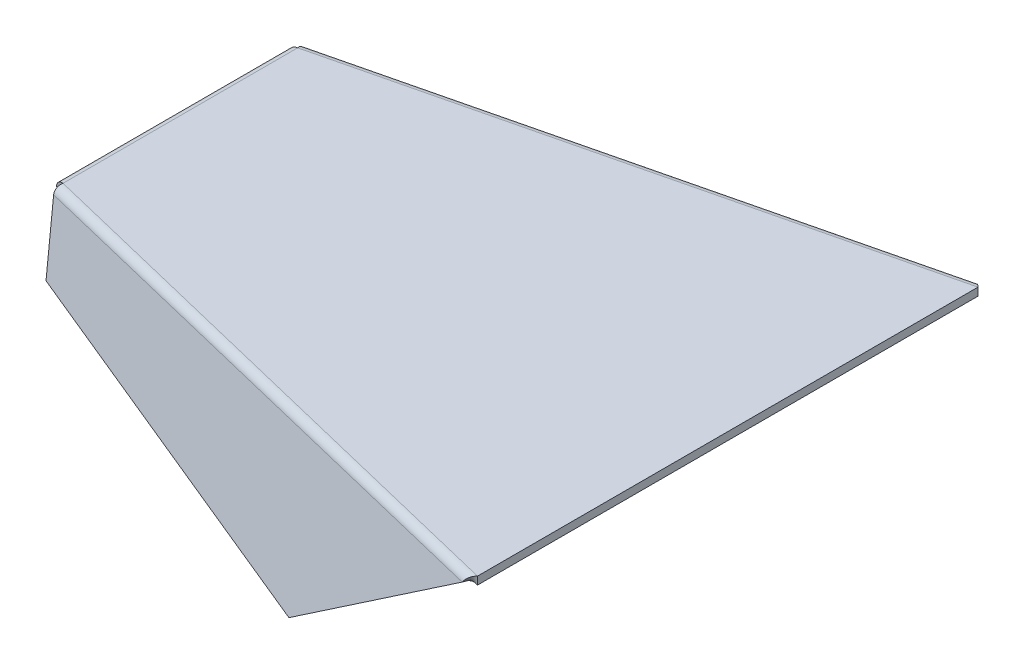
ISO-10303-21;
HEADER;
FILE_DESCRIPTION(('STEP AP214'),'2;1');
FILE_NAME('part.step','',(''),(''),'','','');
FILE_SCHEMA(('AUTOMOTIVE_DESIGN { 1 0 10303 214 1 1 1 1 }'));
ENDSEC;
DATA;
#1=APPLICATION_CONTEXT('core data for automotive mechanical design processes');
#2=APPLICATION_PROTOCOL_DEFINITION('international standard','automotive_design',2000,#1);
#3=PRODUCT_CONTEXT('',#1,'mechanical');
#4=PRODUCT('Part','Part','',(#3));
#5=PRODUCT_RELATED_PRODUCT_CATEGORY('part','',(#4));
#6=PRODUCT_DEFINITION_FORMATION('','',#4);
#7=PRODUCT_DEFINITION_CONTEXT('part definition',#1,'design');
#8=PRODUCT_DEFINITION('design','',#6,#7);
#9=PRODUCT_DEFINITION_SHAPE('','',#8);
#10=(LENGTH_UNIT() NAMED_UNIT(*) SI_UNIT(.MILLI.,.METRE.));
#11=(NAMED_UNIT(*) PLANE_ANGLE_UNIT() SI_UNIT($,.RADIAN.));
#12=(NAMED_UNIT(*) SI_UNIT($,.STERADIAN.) SOLID_ANGLE_UNIT());
#13=UNCERTAINTY_MEASURE_WITH_UNIT(LENGTH_MEASURE(1.E-05),#10,'distance_accuracy_value','');
#14=(GEOMETRIC_REPRESENTATION_CONTEXT(3) GLOBAL_UNCERTAINTY_ASSIGNED_CONTEXT((#13)) GLOBAL_UNIT_ASSIGNED_CONTEXT((#10,
#11,#12)) REPRESENTATION_CONTEXT('',''));
#15=CARTESIAN_POINT('',(0.,0.,0.));
#16=DIRECTION('',(0.,0.,1.));
#17=DIRECTION('',(1.,0.,0.));
#18=AXIS2_PLACEMENT_3D('',#15,#16,#17);
#19=CARTESIAN_POINT('',(35.9989999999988,-0.214031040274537,-15.));
#20=DIRECTION('',(0.,-0.2359973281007,-0.97175370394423));
#21=DIRECTION('',(0.,-0.97175370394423,0.2359973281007));
#22=AXIS2_PLACEMENT_3D('',#19,#20,#21);
#23=PLANE('',#22);
#24=DIRECTION('',(0.,-0.97175370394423,0.2359973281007));
#25=VECTOR('',#24,1.);
#26=CARTESIAN_POINT('',(34.9989999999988,-0.214031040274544,-15.));
#27=LINE('',#26,#25);
#28=CARTESIAN_POINT('',(34.9989999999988,-1.00100000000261,-14.8088789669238));
#29=VERTEX_POINT('',#28);
#30=CARTESIAN_POINT('',(34.9989999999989,-6.21403104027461,-13.5428571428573));
#31=VERTEX_POINT('',#30);
#32=EDGE_CURVE('E127',#29,#31,#27,.T.);
#33=ORIENTED_EDGE('',*,*,#32,.F.);
#34=CARTESIAN_POINT('',(35.9989999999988,-1.001,-14.8088789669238));
#35=CARTESIAN_POINT('',(34.9989999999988,-1.001,-14.8088789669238));
#36=B_SPLINE_CURVE_WITH_KNOTS('',1,(#34,#35),.UNSPECIFIED.,.F.,.F.,(2,2),(0.,1.),.UNSPECIFIED.);
#37=CARTESIAN_POINT('',(35.9989999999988,-1.001,-14.8088789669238));
#38=VERTEX_POINT('',#37);
#39=EDGE_CURVE('E251',#29,#38,#36,.F.);
#40=ORIENTED_EDGE('',*,*,#39,.T.);
#41=DIRECTION('',(0.,-0.97175370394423,0.2359973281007));
#42=VECTOR('',#41,1.);
#43=CARTESIAN_POINT('',(35.9989999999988,-0.214031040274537,-15.));
#44=LINE('',#43,#42);
#45=CARTESIAN_POINT('',(35.9989999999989,-6.2140310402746,-13.5428571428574));
#46=VERTEX_POINT('',#45);
#47=EDGE_CURVE('E268',#38,#46,#44,.T.);
#48=ORIENTED_EDGE('',*,*,#47,.T.);
#49=CARTESIAN_POINT('',(34.9989999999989,-6.21403104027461,-13.5428571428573));
#50=CARTESIAN_POINT('',(35.9989999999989,-6.2140310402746,-13.5428571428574));
#51=B_SPLINE_CURVE_WITH_KNOTS('',1,(#49,#50),.UNSPECIFIED.,.F.,.F.,(2,2),(0.,1.),.UNSPECIFIED.);
#52=EDGE_CURVE('E252',#31,#46,#51,.T.);
#53=ORIENTED_EDGE('',*,*,#52,.F.);
#54=EDGE_LOOP('',(#33,#40,#48,#53));
#55=FACE_BOUND('',#54,.T.);
#56=ADVANCED_FACE('F100',(#55),#23,.T.);
#57=CARTESIAN_POINT('',(35.999,-0.214031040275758,15.));
#58=DIRECTION('',(0.,-0.235997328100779,0.971753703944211));
#59=DIRECTION('',(0.,0.971753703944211,0.235997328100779));
#60=AXIS2_PLACEMENT_3D('',#57,#58,#59);
#61=PLANE('',#60);
#62=DIRECTION('',(0.,0.971753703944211,0.235997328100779));
#63=VECTOR('',#62,1.);
#64=CARTESIAN_POINT('',(35.999,-0.214031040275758,15.));
#65=LINE('',#64,#63);
#66=CARTESIAN_POINT('',(35.999,-6.21403104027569,13.5428571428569));
#67=VERTEX_POINT('',#66);
#68=CARTESIAN_POINT('',(35.999,-1.001,14.8088789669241));
#69=VERTEX_POINT('',#68);
#70=EDGE_CURVE('E274',#67,#69,#65,.T.);
#71=ORIENTED_EDGE('',*,*,#70,.T.);
#72=CARTESIAN_POINT('',(34.999,-1.001,14.8088789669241));
#73=CARTESIAN_POINT('',(35.999,-1.001,14.8088789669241));
#74=B_SPLINE_CURVE_WITH_KNOTS('',1,(#72,#73),.UNSPECIFIED.,.F.,.F.,(2,2),(0.,1.),.UNSPECIFIED.);
#75=CARTESIAN_POINT('',(34.999,-1.00100000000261,14.8088789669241));
#76=VERTEX_POINT('',#75);
#77=EDGE_CURVE('E14',#69,#76,#74,.F.);
#78=ORIENTED_EDGE('',*,*,#77,.T.);
#79=DIRECTION('',(0.,0.971753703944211,0.235997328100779));
#80=VECTOR('',#79,1.);
#81=CARTESIAN_POINT('',(34.999,-0.214031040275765,15.));
#82=LINE('',#81,#80);
#83=CARTESIAN_POINT('',(34.999,-6.2140310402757,13.5428571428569));
#84=VERTEX_POINT('',#83);
#85=EDGE_CURVE('E275',#84,#76,#82,.T.);
#86=ORIENTED_EDGE('',*,*,#85,.F.);
#87=CARTESIAN_POINT('',(35.999,-6.21403104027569,13.5428571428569));
#88=CARTESIAN_POINT('',(34.999,-6.2140310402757,13.5428571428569));
#89=B_SPLINE_CURVE_WITH_KNOTS('',1,(#87,#88),.UNSPECIFIED.,.F.,.F.,(2,2),(0.,1.),.UNSPECIFIED.);
#90=EDGE_CURVE('E310',#67,#84,#89,.T.);
#91=ORIENTED_EDGE('',*,*,#90,.F.);
#92=EDGE_LOOP('',(#71,#78,#86,#91));
#93=FACE_BOUND('',#92,.T.);
#94=ADVANCED_FACE('F102',(#93),#61,.T.);
#95=CARTESIAN_POINT('',(35.9989999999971,16.5295632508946,-53.9442117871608));
#96=DIRECTION('',(1.,0.,0.));
#97=DIRECTION('',(0.,0.,-1.));
#98=AXIS2_PLACEMENT_3D('',#95,#96,#97);
#99=PLANE('',#98);
#100=ORIENTED_EDGE('',*,*,#47,.F.);
#101=DIRECTION('',(0.,0.,1.));
#102=VECTOR('',#101,1.);
#103=CARTESIAN_POINT('',(35.9989999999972,-1.001,-53.9442117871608));
#104=LINE('',#103,#102);
#105=EDGE_CURVE('E242',#38,#69,#104,.T.);
#106=ORIENTED_EDGE('',*,*,#105,.T.);
#107=ORIENTED_EDGE('',*,*,#70,.F.);
#108=DIRECTION('',(0.,0.,1.));
#109=VECTOR('',#108,1.);
#110=CARTESIAN_POINT('',(35.9989999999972,-6.21403104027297,-53.9442117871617));
#111=LINE('',#110,#109);
#112=EDGE_CURVE('E271',#46,#67,#111,.T.);
#113=ORIENTED_EDGE('',*,*,#112,.F.);
#114=EDGE_LOOP('',(#100,#106,#107,#113));
#115=FACE_BOUND('',#114,.T.);
#116=ADVANCED_FACE('F269',(#115),#99,.T.);
#117=CARTESIAN_POINT('',(34.9989999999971,16.5295632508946,-53.9442117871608));
#118=DIRECTION('',(1.,0.,0.));
#119=DIRECTION('',(0.,0.,-1.));
#120=AXIS2_PLACEMENT_3D('',#117,#118,#119);
#121=PLANE('',#120);
#122=DIRECTION('',(0.,0.,1.));
#123=VECTOR('',#122,1.);
#124=CARTESIAN_POINT('',(34.9989999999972,-1.00100000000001,-53.9442117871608));
#125=LINE('',#124,#123);
#126=EDGE_CURVE('E111',#29,#76,#125,.T.);
#127=ORIENTED_EDGE('',*,*,#126,.F.);
#128=ORIENTED_EDGE('',*,*,#32,.T.);
#129=DIRECTION('',(0.,0.,1.));
#130=VECTOR('',#129,1.);
#131=CARTESIAN_POINT('',(34.9989999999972,-6.21403104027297,-53.9442117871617));
#132=LINE('',#131,#130);
#133=EDGE_CURVE('E303',#31,#84,#132,.T.);
#134=ORIENTED_EDGE('',*,*,#133,.T.);
#135=ORIENTED_EDGE('',*,*,#85,.T.);
#136=EDGE_LOOP('',(#127,#128,#134,#135));
#137=FACE_BOUND('',#136,.T.);
#138=ADVANCED_FACE('F295',(#137),#121,.F.);
#139=CARTESIAN_POINT('',(35.7409221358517,-7.18092279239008,-13.3835896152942));
#140=CARTESIAN_POINT('',(35.5296944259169,-7.12432449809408,-13.4101700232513));
#141=CARTESIAN_POINT('',(35.3387972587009,-6.99665716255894,-13.4366787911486));
#142=CARTESIAN_POINT('',(35.0729093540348,-6.65014529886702,-13.4897679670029));
#143=CARTESIAN_POINT('',(34.9989999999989,-6.43271005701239,-13.5162767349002));
#144=CARTESIAN_POINT('',(34.9989999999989,-6.21403104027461,-13.5428571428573));
#145=CARTESIAN_POINT('',(35.9997411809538,-6.21499696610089,-13.3835896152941));
#146=CARTESIAN_POINT('',(35.9995304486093,-6.21494050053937,-13.4101342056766));
#147=CARTESIAN_POINT('',(35.9993394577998,-6.21481288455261,-13.4366787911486));
#148=CARTESIAN_POINT('',(35.9990738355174,-6.21446671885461,-13.489767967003));
#149=CARTESIAN_POINT('',(35.9989999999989,-6.21424920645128,-13.516312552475));
#150=CARTESIAN_POINT('',(35.9989999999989,-6.2140310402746,-13.5428571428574));
#151=B_SPLINE_SURFACE_WITH_KNOTS('',1,3,((#139,#140,#141,#142,#143,#144),(#145,#146,#147,#148,
#149,#150)),.UNSPECIFIED.,.F.,.F.,.F.,(2,2),(4,2,4),(0.,1.),(0.,0.5,1.),.UNSPECIFIED.);
#152=CARTESIAN_POINT('',(35.9997411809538,-6.21499696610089,-13.3835896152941));
#153=CARTESIAN_POINT('',(35.7409221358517,-7.18092279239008,-13.3835896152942));
#154=B_SPLINE_CURVE_WITH_KNOTS('',1,(#152,#153),.UNSPECIFIED.,.F.,.F.,(2,2),(0.,1.),.UNSPECIFIED.);
#155=CARTESIAN_POINT('',(35.7409221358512,-7.18092279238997,-13.3835896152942));
#156=VERTEX_POINT('',#155);
#157=CARTESIAN_POINT('',(35.9997411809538,-6.21499696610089,-13.3835896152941));
#158=VERTEX_POINT('',#157);
#159=EDGE_CURVE('E456',#156,#158,#154,.F.);
#160=CARTESIAN_POINT('',(35.7409221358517,-7.18092279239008,-13.3835896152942));
#161=CARTESIAN_POINT('',(35.5296944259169,-7.12432449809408,-13.4101700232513));
#162=CARTESIAN_POINT('',(35.3387972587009,-6.99665716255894,-13.4366787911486));
#163=CARTESIAN_POINT('',(35.0729093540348,-6.65014529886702,-13.4897679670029));
#164=CARTESIAN_POINT('',(34.9989999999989,-6.43271005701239,-13.5162767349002));
#165=CARTESIAN_POINT('',(34.9989999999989,-6.21403104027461,-13.5428571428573));
#166=B_SPLINE_CURVE_WITH_KNOTS('',3,(#160,#161,#162,#163,#164,#165),.UNSPECIFIED.,.F.,.F.,(4,2,
4),(0.,0.5,1.),.UNSPECIFIED.);
#167=EDGE_CURVE('E990',#156,#31,#166,.T.);
#168=CARTESIAN_POINT('',(35.9989999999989,-6.2140310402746,-13.5428571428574));
#169=CARTESIAN_POINT('',(35.9989999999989,-6.21424920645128,-13.516312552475));
#170=CARTESIAN_POINT('',(35.9990738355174,-6.21446671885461,-13.489767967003));
#171=CARTESIAN_POINT('',(35.9993394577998,-6.21481288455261,-13.4366787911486));
#172=CARTESIAN_POINT('',(35.9995304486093,-6.21494050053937,-13.4101342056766));
#173=CARTESIAN_POINT('',(35.9997411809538,-6.21499696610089,-13.3835896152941));
#174=B_SPLINE_CURVE_WITH_KNOTS('',3,(#168,#169,#170,#171,#172,#173),.UNSPECIFIED.,.F.,.F.,(4,2,
4),(0.,0.5,1.),.UNSPECIFIED.);
#175=EDGE_CURVE('E982',#158,#46,#174,.F.);
#176=ORIENTED_EDGE('',*,*,#159,.F.);
#177=ORIENTED_EDGE('',*,*,#167,.T.);
#178=ORIENTED_EDGE('',*,*,#52,.T.);
#179=ORIENTED_EDGE('',*,*,#175,.F.);
#180=EDGE_LOOP('',(#176,#177,#178,#179));
#181=FACE_BOUND('',#180,.T.);
#182=ADVANCED_FACE('F354',(#181),#151,.F.);
#183=CARTESIAN_POINT('',(34.999,-6.2140310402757,13.5428571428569));
#184=CARTESIAN_POINT('',(34.999,-6.43271005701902,13.5162767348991));
#185=CARTESIAN_POINT('',(35.0729093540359,-6.65014529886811,13.4897679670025));
#186=CARTESIAN_POINT('',(35.338797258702,-6.99665716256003,13.4366787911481));
#187=CARTESIAN_POINT('',(35.5296944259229,-7.12432449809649,13.4101700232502));
#188=CARTESIAN_POINT('',(35.7409221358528,-7.18092279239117,13.3835896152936));
#189=CARTESIAN_POINT('',(35.999,-6.21403104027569,13.5428571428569));
#190=CARTESIAN_POINT('',(35.999,-6.21424920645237,13.5163125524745));
#191=CARTESIAN_POINT('',(35.9990738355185,-6.2144667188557,13.4897679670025));
#192=CARTESIAN_POINT('',(35.9993394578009,-6.2148128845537,13.4366787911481));
#193=CARTESIAN_POINT('',(35.9995304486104,-6.21494050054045,13.4101342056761));
#194=CARTESIAN_POINT('',(35.9997411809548,-6.21499696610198,13.3835896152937));
#195=B_SPLINE_SURFACE_WITH_KNOTS('',1,3,((#183,#184,#185,#186,#187,#188),(#189,#190,#191,#192,
#193,#194)),.UNSPECIFIED.,.F.,.F.,.F.,(2,2),(4,2,4),(0.,1.),(0.,0.5,1.),.UNSPECIFIED.);
#196=CARTESIAN_POINT('',(34.999,-6.2140310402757,13.5428571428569));
#197=CARTESIAN_POINT('',(34.999,-6.43271005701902,13.5162767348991));
#198=CARTESIAN_POINT('',(35.0729093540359,-6.65014529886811,13.4897679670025));
#199=CARTESIAN_POINT('',(35.338797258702,-6.99665716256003,13.4366787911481));
#200=CARTESIAN_POINT('',(35.5296944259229,-7.12432449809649,13.4101700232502));
#201=CARTESIAN_POINT('',(35.7409221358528,-7.18092279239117,13.3835896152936));
#202=B_SPLINE_CURVE_WITH_KNOTS('',3,(#196,#197,#198,#199,#200,#201),.UNSPECIFIED.,.F.,.F.,(4,2,
4),(0.,0.5,1.),.UNSPECIFIED.);
#203=CARTESIAN_POINT('',(35.7409221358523,-7.18092279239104,13.3835896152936));
#204=VERTEX_POINT('',#203);
#205=EDGE_CURVE('E386',#84,#204,#202,.T.);
#206=CARTESIAN_POINT('',(35.7409221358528,-7.18092279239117,13.3835896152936));
#207=CARTESIAN_POINT('',(35.9997411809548,-6.21499696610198,13.3835896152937));
#208=B_SPLINE_CURVE_WITH_KNOTS('',1,(#206,#207),.UNSPECIFIED.,.F.,.F.,(2,2),(0.,1.),.UNSPECIFIED.);
#209=CARTESIAN_POINT('',(35.9997411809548,-6.21499696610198,13.3835896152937));
#210=VERTEX_POINT('',#209);
#211=EDGE_CURVE('E467',#210,#204,#208,.F.);
#212=CARTESIAN_POINT('',(35.9997411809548,-6.21499696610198,13.3835896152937));
#213=CARTESIAN_POINT('',(35.9995304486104,-6.21494050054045,13.4101342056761));
#214=CARTESIAN_POINT('',(35.9993394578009,-6.2148128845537,13.4366787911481));
#215=CARTESIAN_POINT('',(35.9990738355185,-6.2144667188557,13.4897679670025));
#216=CARTESIAN_POINT('',(35.999,-6.21424920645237,13.5163125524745));
#217=CARTESIAN_POINT('',(35.999,-6.21403104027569,13.5428571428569));
#218=B_SPLINE_CURVE_WITH_KNOTS('',3,(#212,#213,#214,#215,#216,#217),.UNSPECIFIED.,.F.,.F.,(4,2,
4),(0.,0.5,1.),.UNSPECIFIED.);
#219=EDGE_CURVE('E326',#67,#210,#218,.F.);
#220=ORIENTED_EDGE('',*,*,#205,.T.);
#221=ORIENTED_EDGE('',*,*,#211,.F.);
#222=ORIENTED_EDGE('',*,*,#219,.F.);
#223=ORIENTED_EDGE('',*,*,#90,.T.);
#224=EDGE_LOOP('',(#220,#221,#222,#223));
#225=FACE_BOUND('',#224,.T.);
#226=ADVANCED_FACE('F352',(#225),#195,.F.);
#227=CARTESIAN_POINT('',(36.0000000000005,-6.21403104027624,27.1121006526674));
#228=DIRECTION('',(0.,0.,-1.));
#229=DIRECTION('',(0.,-1.,0.));
#230=AXIS2_PLACEMENT_3D('',#227,#228,#229);
#231=CYLINDRICAL_SURFACE('',#230,0.001);
#232=ORIENTED_EDGE('',*,*,#112,.T.);
#233=ORIENTED_EDGE('',*,*,#219,.T.);
#234=DIRECTION('',(0.,0.,1.));
#235=VECTOR('',#234,1.);
#236=CARTESIAN_POINT('',(35.9997411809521,-6.21499696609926,-53.9442117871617));
#237=LINE('',#236,#235);
#238=EDGE_CURVE('E459',#158,#210,#237,.T.);
#239=ORIENTED_EDGE('',*,*,#238,.F.);
#240=ORIENTED_EDGE('',*,*,#175,.T.);
#241=EDGE_LOOP('',(#232,#233,#239,#240));
#242=FACE_BOUND('',#241,.T.);
#243=ADVANCED_FACE('F347',(#242),#231,.F.);
#244=CARTESIAN_POINT('',(36.0000000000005,-6.21403104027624,27.1121006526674));
#245=DIRECTION('',(0.,0.,-1.));
#246=DIRECTION('',(0.,-1.,0.));
#247=AXIS2_PLACEMENT_3D('',#244,#245,#246);
#248=CYLINDRICAL_SURFACE('',#247,1.001);
#249=ORIENTED_EDGE('',*,*,#133,.F.);
#250=ORIENTED_EDGE('',*,*,#167,.F.);
#251=DIRECTION('',(0.,0.,1.));
#252=VECTOR('',#251,1.);
#253=CARTESIAN_POINT('',(35.7409221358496,-7.18092279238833,-53.9442117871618));
#254=LINE('',#253,#252);
#255=EDGE_CURVE('E477',#156,#204,#254,.T.);
#256=ORIENTED_EDGE('',*,*,#255,.T.);
#257=ORIENTED_EDGE('',*,*,#205,.F.);
#258=EDGE_LOOP('',(#249,#250,#256,#257));
#259=FACE_BOUND('',#258,.T.);
#260=ADVANCED_FACE('F351',(#259),#248,.T.);
#261=CARTESIAN_POINT('',(64.3440546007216,-13.8098328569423,-6.25714285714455));
#262=DIRECTION('',(0.96592582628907,-0.258819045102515,0.));
#263=DIRECTION('',(0.,0.,1.));
#264=AXIS2_PLACEMENT_3D('',#261,#262,#263);
#265=PLANE('',#264);
#266=DIRECTION('',(0.,0.,1.));
#267=VECTOR('',#266,1.);
#268=CARTESIAN_POINT('',(64.0852355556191,-14.7757586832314,-6.25714285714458));
#269=LINE('',#268,#267);
#270=CARTESIAN_POINT('',(64.0852355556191,-14.7757586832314,-6.25714285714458));
#271=VERTEX_POINT('',#270);
#272=CARTESIAN_POINT('',(64.0852355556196,-14.7757586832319,6.25714285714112));
#273=VERTEX_POINT('',#272);
#274=EDGE_CURVE('E1001',#271,#273,#269,.T.);
#275=ORIENTED_EDGE('',*,*,#274,.F.);
#276=DIRECTION('',(-0.258819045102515,-0.96592582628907,0.));
#277=VECTOR('',#276,1.);
#278=CARTESIAN_POINT('',(64.3440546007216,-13.8098328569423,-6.25714285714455));
#279=LINE('',#278,#277);
#280=CARTESIAN_POINT('',(64.3440546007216,-13.8098328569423,-6.25714285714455));
#281=VERTEX_POINT('',#280);
#282=EDGE_CURVE('E455',#281,#271,#279,.T.);
#283=ORIENTED_EDGE('',*,*,#282,.F.);
#284=DIRECTION('',(0.,0.,1.));
#285=VECTOR('',#284,1.);
#286=CARTESIAN_POINT('',(64.3440546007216,-13.8098328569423,-6.25714285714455));
#287=LINE('',#286,#285);
#288=CARTESIAN_POINT('',(64.3440546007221,-13.8098328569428,6.25714285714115));
#289=VERTEX_POINT('',#288);
#290=EDGE_CURVE('E1012',#281,#289,#287,.T.);
#291=ORIENTED_EDGE('',*,*,#290,.T.);
#292=DIRECTION('',(-0.258819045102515,-0.96592582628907,0.));
#293=VECTOR('',#292,1.);
#294=CARTESIAN_POINT('',(64.3440546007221,-13.8098328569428,6.25714285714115));
#295=LINE('',#294,#293);
#296=EDGE_CURVE('E1011',#289,#273,#295,.T.);
#297=ORIENTED_EDGE('',*,*,#296,.T.);
#298=EDGE_LOOP('',(#275,#283,#291,#297));
#299=FACE_BOUND('',#298,.T.);
#300=ADVANCED_FACE('F495',(#299),#265,.T.);
#301=CARTESIAN_POINT('',(52.752944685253,-10.7040043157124,-1.10404625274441E-12));
#302=DIRECTION('',(-0.258819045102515,-0.96592582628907,0.));
#303=DIRECTION('',(0.,0.,1.));
#304=AXIS2_PLACEMENT_3D('',#301,#302,#303);
#305=CYLINDRICAL_SURFACE('',#304,4.25);
#306=CARTESIAN_POINT('',(52.752944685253,-10.7040043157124,-1.10404625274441E-12));
#307=DIRECTION('',(-0.258819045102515,-0.96592582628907,0.));
#308=DIRECTION('',(0.,0.,1.));
#309=AXIS2_PLACEMENT_3D('',#306,#307,#308);
#310=CIRCLE('',#309,4.25);
#311=CARTESIAN_POINT('',(52.7529446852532,-10.7040043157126,4.2499999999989));
#312=VERTEX_POINT('',#311);
#313=EDGE_CURVE('E462',#312,#312,#310,.T.);
#314=ORIENTED_EDGE('',*,*,#313,.F.);
#315=EDGE_LOOP('',(#314));
#316=FACE_BOUND('',#315,.T.);
#317=CARTESIAN_POINT('',(52.4941256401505,-11.6699301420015,-1.1325440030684E-12));
#318=DIRECTION('',(-0.258819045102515,-0.96592582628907,0.));
#319=DIRECTION('',(0.,0.,1.));
#320=AXIS2_PLACEMENT_3D('',#317,#318,#319);
#321=CIRCLE('',#320,4.25);
#322=CARTESIAN_POINT('',(52.4941256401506,-11.6699301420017,4.24999999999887));
#323=VERTEX_POINT('',#322);
#324=EDGE_CURVE('E1008',#323,#323,#321,.T.);
#325=ORIENTED_EDGE('',*,*,#324,.T.);
#326=EDGE_LOOP('',(#325));
#327=FACE_BOUND('',#326,.T.);
#328=ADVANCED_FACE('F491',(#316,#327),#305,.F.);
#329=CARTESIAN_POINT('',(13.3976547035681,-0.158786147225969,-53.9442117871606));
#330=DIRECTION('',(0.258819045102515,0.96592582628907,0.));
#331=DIRECTION('',(0.,0.,-1.));
#332=AXIS2_PLACEMENT_3D('',#329,#330,#331);
#333=PLANE('',#332);
#334=ORIENTED_EDGE('',*,*,#313,.T.);
#335=EDGE_LOOP('',(#334));
#336=FACE_BOUND('',#335,.T.);
#337=DIRECTION('',(0.938641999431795,-0.251508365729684,0.235997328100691));
#338=VECTOR('',#337,1.);
#339=CARTESIAN_POINT('',(29.5707248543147,-4.49234723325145,-14.9999999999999));
#340=LINE('',#339,#338);
#341=EDGE_CURVE('E453',#158,#281,#340,.T.);
#342=ORIENTED_EDGE('',*,*,#341,.F.);
#343=ORIENTED_EDGE('',*,*,#238,.T.);
#344=DIRECTION('',(-0.938641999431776,0.251508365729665,0.235997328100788));
#345=VECTOR('',#344,1.);
#346=CARTESIAN_POINT('',(29.5707248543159,-4.49234723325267,15.0000000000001));
#347=LINE('',#346,#345);
#348=EDGE_CURVE('E461',#289,#210,#347,.T.);
#349=ORIENTED_EDGE('',*,*,#348,.F.);
#350=ORIENTED_EDGE('',*,*,#290,.F.);
#351=EDGE_LOOP('',(#342,#343,#349,#350));
#352=FACE_BOUND('',#351,.T.);
#353=ADVANCED_FACE('F488',(#336,#352),#333,.T.);
#354=CARTESIAN_POINT('',(29.5707248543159,-4.49234723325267,15.0000000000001));
#355=DIRECTION('',(0.227955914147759,-0.0610806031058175,0.971753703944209));
#356=DIRECTION('',(-0.938641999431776,0.251508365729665,0.235997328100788));
#357=AXIS2_PLACEMENT_3D('',#354,#355,#356);
#358=PLANE('',#357);
#359=ORIENTED_EDGE('',*,*,#348,.T.);
#360=ORIENTED_EDGE('',*,*,#211,.T.);
#361=DIRECTION('',(-0.938641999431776,0.251508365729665,0.235997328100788));
#362=VECTOR('',#361,1.);
#363=CARTESIAN_POINT('',(29.3119058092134,-5.45827305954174,15.0000000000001));
#364=LINE('',#363,#362);
#365=EDGE_CURVE('E1004',#273,#204,#364,.T.);
#366=ORIENTED_EDGE('',*,*,#365,.F.);
#367=ORIENTED_EDGE('',*,*,#296,.F.);
#368=EDGE_LOOP('',(#359,#360,#366,#367));
#369=FACE_BOUND('',#368,.T.);
#370=ADVANCED_FACE('F479',(#369),#358,.T.);
#371=CARTESIAN_POINT('',(13.1388356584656,-1.12471197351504,-53.9442117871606));
#372=DIRECTION('',(0.258819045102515,0.96592582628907,0.));
#373=DIRECTION('',(0.,0.,-1.));
#374=AXIS2_PLACEMENT_3D('',#371,#372,#373);
#375=PLANE('',#374);
#376=ORIENTED_EDGE('',*,*,#255,.F.);
#377=DIRECTION('',(0.938641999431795,-0.251508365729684,0.235997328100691));
#378=VECTOR('',#377,1.);
#379=CARTESIAN_POINT('',(29.3119058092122,-5.45827305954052,-14.9999999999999));
#380=LINE('',#379,#378);
#381=EDGE_CURVE('E1005',#156,#271,#380,.T.);
#382=ORIENTED_EDGE('',*,*,#381,.T.);
#383=ORIENTED_EDGE('',*,*,#274,.T.);
#384=ORIENTED_EDGE('',*,*,#365,.T.);
#385=EDGE_LOOP('',(#376,#382,#383,#384));
#386=FACE_BOUND('',#385,.T.);
#387=ORIENTED_EDGE('',*,*,#324,.F.);
#388=EDGE_LOOP('',(#387));
#389=FACE_BOUND('',#388,.T.);
#390=ADVANCED_FACE('F344',(#386,#389),#375,.F.);
#391=CARTESIAN_POINT('',(29.5707248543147,-4.49234723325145,-14.9999999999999));
#392=DIRECTION('',(0.22795591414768,-0.061080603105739,-0.971753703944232));
#393=DIRECTION('',(0.938641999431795,-0.251508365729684,0.235997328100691));
#394=AXIS2_PLACEMENT_3D('',#391,#392,#393);
#395=PLANE('',#394);
#396=ORIENTED_EDGE('',*,*,#381,.F.);
#397=ORIENTED_EDGE('',*,*,#159,.T.);
#398=ORIENTED_EDGE('',*,*,#341,.T.);
#399=ORIENTED_EDGE('',*,*,#282,.T.);
#400=EDGE_LOOP('',(#396,#397,#398,#399));
#401=FACE_BOUND('',#400,.T.);
#402=ADVANCED_FACE('F333',(#401),#395,.T.);
#403=CARTESIAN_POINT('',(78.0911873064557,-20.7765675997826,27.0036069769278));
#404=DIRECTION('',(0.555161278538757,-0.805483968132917,0.207343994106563));
#405=DIRECTION('',(0.797824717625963,0.586173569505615,0.140983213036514));
#406=AXIS2_PLACEMENT_3D('',#403,#404,#405);
#407=PLANE('',#406);
#408=DIRECTION('',(0.797824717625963,0.586173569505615,0.140983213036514));
#409=VECTOR('',#408,1.);
#410=CARTESIAN_POINT('',(78.0911873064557,-20.7765675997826,27.0036069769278));
#411=LINE('',#410,#409);
#412=CARTESIAN_POINT('',(78.0911873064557,-20.7765675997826,27.0036069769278));
#413=VERTEX_POINT('',#412);
#414=CARTESIAN_POINT('',(105.007286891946,-1.00091284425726,31.75993768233));
#415=VERTEX_POINT('',#414);
#416=EDGE_CURVE('E629',#413,#415,#411,.T.);
#417=ORIENTED_EDGE('',*,*,#416,.T.);
#418=CARTESIAN_POINT('',(104.772187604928,-0.913757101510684,32.7279935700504));
#419=CARTESIAN_POINT('',(105.007286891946,-1.00091284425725,31.75993768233));
#420=B_SPLINE_CURVE_WITH_KNOTS('',1,(#418,#419),.UNSPECIFIED.,.F.,.F.,(2,2),(0.,1.),.UNSPECIFIED.);
#421=CARTESIAN_POINT('',(104.772187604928,-0.913757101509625,32.7279935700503));
#422=VERTEX_POINT('',#421);
#423=EDGE_CURVE('E626',#415,#422,#420,.F.);
#424=ORIENTED_EDGE('',*,*,#423,.T.);
#425=DIRECTION('',(0.797824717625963,0.586173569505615,0.140983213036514));
#426=VECTOR('',#425,1.);
#427=CARTESIAN_POINT('',(77.8560880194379,-20.689411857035,27.9716628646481));
#428=LINE('',#427,#426);
#429=CARTESIAN_POINT('',(77.8560880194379,-20.689411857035,27.9716628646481));
#430=VERTEX_POINT('',#429);
#431=EDGE_CURVE('E607',#430,#422,#428,.T.);
#432=ORIENTED_EDGE('',*,*,#431,.F.);
#433=DIRECTION('',(-0.235099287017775,0.087155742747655,0.968055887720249));
#434=VECTOR('',#433,1.);
#435=CARTESIAN_POINT('',(78.0911873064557,-20.7765675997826,27.0036069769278));
#436=LINE('',#435,#434);
#437=EDGE_CURVE('E616',#413,#430,#436,.T.);
#438=ORIENTED_EDGE('',*,*,#437,.F.);
#439=EDGE_LOOP('',(#417,#424,#432,#438));
#440=FACE_BOUND('',#439,.T.);
#441=ADVANCED_FACE('F343',(#440),#407,.T.);
#442=CARTESIAN_POINT('',(78.0911873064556,-20.7765675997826,-27.0036069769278));
#443=DIRECTION('',(0.555161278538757,-0.805483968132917,-0.207343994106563));
#444=DIRECTION('',(-0.797824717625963,-0.586173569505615,0.140983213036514));
#445=AXIS2_PLACEMENT_3D('',#442,#443,#444);
#446=PLANE('',#445);
#447=CARTESIAN_POINT('',(105.007286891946,-1.00091284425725,-31.75993768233));
#448=CARTESIAN_POINT('',(104.772187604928,-0.913757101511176,-32.7279935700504));
#449=B_SPLINE_CURVE_WITH_KNOTS('',1,(#447,#448),.UNSPECIFIED.,.F.,.F.,(2,2),(0.,1.),.UNSPECIFIED.);
#450=CARTESIAN_POINT('',(105.007286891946,-1.00091284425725,-31.75993768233));
#451=VERTEX_POINT('',#450);
#452=CARTESIAN_POINT('',(104.772187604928,-0.913757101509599,-32.7279935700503));
#453=VERTEX_POINT('',#452);
#454=EDGE_CURVE('E789',#451,#453,#449,.T.);
#455=ORIENTED_EDGE('',*,*,#454,.F.);
#456=DIRECTION('',(-0.797824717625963,-0.586173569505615,0.140983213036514));
#457=VECTOR('',#456,1.);
#458=CARTESIAN_POINT('',(78.0911873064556,-20.7765675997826,-27.0036069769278));
#459=LINE('',#458,#457);
#460=CARTESIAN_POINT('',(78.0911873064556,-20.7765675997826,-27.0036069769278));
#461=VERTEX_POINT('',#460);
#462=EDGE_CURVE('E624',#451,#461,#459,.T.);
#463=ORIENTED_EDGE('',*,*,#462,.T.);
#464=DIRECTION('',(-0.235099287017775,0.087155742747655,-0.968055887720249));
#465=VECTOR('',#464,1.);
#466=CARTESIAN_POINT('',(78.0911873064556,-20.7765675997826,-27.0036069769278));
#467=LINE('',#466,#465);
#468=CARTESIAN_POINT('',(77.8560880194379,-20.6894118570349,-27.9716628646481));
#469=VERTEX_POINT('',#468);
#470=EDGE_CURVE('E621',#461,#469,#467,.T.);
#471=ORIENTED_EDGE('',*,*,#470,.T.);
#472=DIRECTION('',(-0.797824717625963,-0.586173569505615,0.140983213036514));
#473=VECTOR('',#472,1.);
#474=CARTESIAN_POINT('',(77.8560880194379,-20.6894118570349,-27.9716628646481));
#475=LINE('',#474,#473);
#476=EDGE_CURVE('E591',#453,#469,#475,.T.);
#477=ORIENTED_EDGE('',*,*,#476,.F.);
#478=EDGE_LOOP('',(#455,#463,#471,#477));
#479=FACE_BOUND('',#478,.T.);
#480=ADVANCED_FACE('F923',(#479),#446,.T.);
#481=CARTESIAN_POINT('',(35.8093671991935,-10.2224396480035,15.7849585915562));
#482=DIRECTION('',(-0.248772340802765,-0.968192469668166,0.0267518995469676));
#483=DIRECTION('',(0.939596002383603,-0.234536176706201,0.249303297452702));
#484=AXIS2_PLACEMENT_3D('',#481,#482,#483);
#485=PLANE('',#484);
#486=DIRECTION('',(0.939596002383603,-0.234536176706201,0.249303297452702));
#487=VECTOR('',#486,1.);
#488=CARTESIAN_POINT('',(35.5742679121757,-10.1352839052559,16.7530144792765));
#489=LINE('',#488,#487);
#490=CARTESIAN_POINT('',(35.5742679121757,-10.1352839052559,16.7530144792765));
#491=VERTEX_POINT('',#490);
#492=EDGE_CURVE('E609',#491,#430,#489,.T.);
#493=ORIENTED_EDGE('',*,*,#492,.F.);
#494=DIRECTION('',(-0.235099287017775,0.087155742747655,0.968055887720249));
#495=VECTOR('',#494,1.);
#496=CARTESIAN_POINT('',(35.8093671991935,-10.2224396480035,15.7849585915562));
#497=LINE('',#496,#495);
#498=CARTESIAN_POINT('',(35.8093671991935,-10.2224396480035,15.7849585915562));
#499=VERTEX_POINT('',#498);
#500=EDGE_CURVE('E573',#499,#491,#497,.T.);
#501=ORIENTED_EDGE('',*,*,#500,.F.);
#502=DIRECTION('',(0.939596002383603,-0.234536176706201,0.249303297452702));
#503=VECTOR('',#502,1.);
#504=CARTESIAN_POINT('',(35.8093671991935,-10.2224396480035,15.7849585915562));
#505=LINE('',#504,#503);
#506=EDGE_CURVE('E618',#499,#413,#505,.T.);
#507=ORIENTED_EDGE('',*,*,#506,.T.);
#508=ORIENTED_EDGE('',*,*,#437,.T.);
#509=EDGE_LOOP('',(#493,#501,#507,#508));
#510=FACE_BOUND('',#509,.T.);
#511=ADVANCED_FACE('F932',(#510),#485,.T.);
#512=CARTESIAN_POINT('',(37.2392535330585,70.5049203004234,9.89719133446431));
#513=DIRECTION('',(0.235099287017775,-0.087155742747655,-0.968055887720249));
#514=DIRECTION('',(-0.209343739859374,0.968055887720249,-0.137996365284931));
#515=AXIS2_PLACEMENT_3D('',#512,#513,#514);
#516=PLANE('',#515);
#517=DIRECTION('',(0.971753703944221,0.,0.235997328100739));
#518=VECTOR('',#517,1.);
#519=CARTESIAN_POINT('',(35.764665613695,-0.913757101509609,15.9690239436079));
#520=LINE('',#519,#518);
#521=CARTESIAN_POINT('',(35.7646656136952,-0.913757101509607,15.969023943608));
#522=VERTEX_POINT('',#521);
#523=EDGE_CURVE('E570',#522,#422,#520,.T.);
#524=ORIENTED_EDGE('',*,*,#523,.F.);
#525=DIRECTION('',(-0.0205685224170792,-0.996194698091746,0.0846939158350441));
#526=VECTOR('',#525,1.);
#527=CARTESIAN_POINT('',(35.7799531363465,-0.173336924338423,15.906075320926));
#528=LINE('',#527,#526);
#529=EDGE_CURVE('E614',#522,#491,#528,.T.);
#530=ORIENTED_EDGE('',*,*,#529,.T.);
#531=ORIENTED_EDGE('',*,*,#492,.T.);
#532=ORIENTED_EDGE('',*,*,#431,.T.);
#533=EDGE_LOOP('',(#524,#530,#531,#532));
#534=FACE_BOUND('',#533,.T.);
#535=ADVANCED_FACE('F935',(#534),#516,.F.);
#536=CARTESIAN_POINT('',(35.8093671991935,-10.2224396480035,-15.7849585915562));
#537=DIRECTION('',(-0.248772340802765,-0.968192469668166,-0.0267518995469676));
#538=DIRECTION('',(-0.939596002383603,0.234536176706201,0.249303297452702));
#539=AXIS2_PLACEMENT_3D('',#536,#537,#538);
#540=PLANE('',#539);
#541=DIRECTION('',(-0.939596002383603,0.234536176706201,0.249303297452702));
#542=VECTOR('',#541,1.);
#543=CARTESIAN_POINT('',(35.5742679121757,-10.1352839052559,-16.7530144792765));
#544=LINE('',#543,#542);
#545=CARTESIAN_POINT('',(35.5742679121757,-10.1352839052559,-16.7530144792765));
#546=VERTEX_POINT('',#545);
#547=EDGE_CURVE('E586',#469,#546,#544,.T.);
#548=ORIENTED_EDGE('',*,*,#547,.F.);
#549=ORIENTED_EDGE('',*,*,#470,.F.);
#550=DIRECTION('',(-0.939596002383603,0.234536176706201,0.249303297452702));
#551=VECTOR('',#550,1.);
#552=CARTESIAN_POINT('',(35.8093671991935,-10.2224396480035,-15.7849585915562));
#553=LINE('',#552,#551);
#554=CARTESIAN_POINT('',(35.8093671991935,-10.2224396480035,-15.7849585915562));
#555=VERTEX_POINT('',#554);
#556=EDGE_CURVE('E604',#461,#555,#553,.T.);
#557=ORIENTED_EDGE('',*,*,#556,.T.);
#558=DIRECTION('',(-0.235099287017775,0.087155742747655,-0.968055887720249));
#559=VECTOR('',#558,1.);
#560=CARTESIAN_POINT('',(35.8093671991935,-10.2224396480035,-15.7849585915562));
#561=LINE('',#560,#559);
#562=EDGE_CURVE('E602',#555,#546,#561,.T.);
#563=ORIENTED_EDGE('',*,*,#562,.T.);
#564=EDGE_LOOP('',(#548,#549,#557,#563));
#565=FACE_BOUND('',#564,.T.);
#566=ADVANCED_FACE('F939',(#565),#540,.T.);
#567=CARTESIAN_POINT('',(59.8250196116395,-33.937103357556,-24.785401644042));
#568=DIRECTION('',(0.235099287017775,-0.087155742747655,0.968055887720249));
#569=DIRECTION('',(0.209343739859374,-0.968055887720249,-0.137996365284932));
#570=AXIS2_PLACEMENT_3D('',#567,#568,#569);
#571=PLANE('',#570);
#572=DIRECTION('',(0.0205685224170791,0.996194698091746,0.0846939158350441));
#573=VECTOR('',#572,1.);
#574=CARTESIAN_POINT('',(35.7799531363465,-0.173336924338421,-15.906075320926));
#575=LINE('',#574,#573);
#576=CARTESIAN_POINT('',(35.7646656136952,-0.913757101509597,-15.969023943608));
#577=VERTEX_POINT('',#576);
#578=EDGE_CURVE('E598',#546,#577,#575,.T.);
#579=ORIENTED_EDGE('',*,*,#578,.T.);
#580=DIRECTION('',(0.971753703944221,0.,-0.235997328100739));
#581=VECTOR('',#580,1.);
#582=CARTESIAN_POINT('',(60.5068556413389,-0.9137571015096,-21.97784152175));
#583=LINE('',#582,#581);
#584=EDGE_CURVE('E593',#577,#453,#583,.T.);
#585=ORIENTED_EDGE('',*,*,#584,.T.);
#586=ORIENTED_EDGE('',*,*,#476,.T.);
#587=ORIENTED_EDGE('',*,*,#547,.T.);
#588=EDGE_LOOP('',(#579,#585,#586,#587));
#589=FACE_BOUND('',#588,.T.);
#590=ADVANCED_FACE('F786',(#589),#571,.F.);
#591=CARTESIAN_POINT('',(37.4743528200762,70.4177645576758,8.92913544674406));
#592=DIRECTION('',(0.235099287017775,-0.087155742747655,-0.968055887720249));
#593=DIRECTION('',(-0.209343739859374,0.968055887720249,-0.137996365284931));
#594=AXIS2_PLACEMENT_3D('',#591,#592,#593);
#595=PLANE('',#594);
#596=DIRECTION('',(-0.0205685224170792,-0.996194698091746,0.0846939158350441));
#597=VECTOR('',#596,1.);
#598=CARTESIAN_POINT('',(36.0150524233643,-0.260492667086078,14.9380194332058));
#599=LINE('',#598,#597);
#600=CARTESIAN_POINT('',(35.999764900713,-1.00091284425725,15.0009680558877));
#601=VERTEX_POINT('',#600);
#602=EDGE_CURVE('E578',#601,#499,#599,.T.);
#603=ORIENTED_EDGE('',*,*,#602,.F.);
#604=DIRECTION('',(0.971753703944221,0.,0.235997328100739));
#605=VECTOR('',#604,1.);
#606=CARTESIAN_POINT('',(35.9997649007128,-1.00091284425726,15.0009680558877));
#607=LINE('',#606,#605);
#608=EDGE_CURVE('E583',#601,#415,#607,.T.);
#609=ORIENTED_EDGE('',*,*,#608,.T.);
#610=ORIENTED_EDGE('',*,*,#416,.F.);
#611=ORIENTED_EDGE('',*,*,#506,.F.);
#612=EDGE_LOOP('',(#603,#609,#610,#611));
#613=FACE_BOUND('',#612,.T.);
#614=ADVANCED_FACE('F946',(#613),#595,.T.);
#615=CARTESIAN_POINT('',(106.,0.,32.));
#616=CARTESIAN_POINT('',(105.888077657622,0.,32.1001795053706));
#617=CARTESIAN_POINT('',(105.776186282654,-0.0232080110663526,32.2003018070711));
#618=CARTESIAN_POINT('',(105.556334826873,-0.112912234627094,32.3842884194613));
#619=CARTESIAN_POINT('',(105.448402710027,-0.179380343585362,32.4680727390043));
#620=CARTESIAN_POINT('',(105.239925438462,-0.346590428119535,32.6052244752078));
#621=CARTESIAN_POINT('',(105.139393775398,-0.447280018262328,32.6585363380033));
#622=CARTESIAN_POINT('',(104.948146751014,-0.669258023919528,32.7247399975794));
#623=CARTESIAN_POINT('',(104.857447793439,-0.790464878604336,32.7375994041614));
#624=CARTESIAN_POINT('',(104.772187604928,-0.913757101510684,32.7279935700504));
#625=CARTESIAN_POINT('',(106.,-1.,32.));
#626=CARTESIAN_POINT('',(105.917264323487,-1.,31.9800342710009));
#627=CARTESIAN_POINT('',(105.834528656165,-1.00002318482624,31.9600685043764));
#628=CARTESIAN_POINT('',(105.669061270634,-1.00011279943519,31.920120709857));
#629=CARTESIAN_POINT('',(105.586329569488,-1.00017920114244,31.9001386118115));
#630=CARTESIAN_POINT('',(105.420873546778,-1.00034624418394,31.860144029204));
#631=CARTESIAN_POINT('',(105.338149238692,-1.00044683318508,31.8401314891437));
#632=CARTESIAN_POINT('',(105.172710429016,-1.00066858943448,31.8000660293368));
#633=CARTESIAN_POINT('',(105.089995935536,-1.00078968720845,31.7800130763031));
#634=CARTESIAN_POINT('',(105.007286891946,-1.00091284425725,31.75993768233));
#635=B_SPLINE_SURFACE_WITH_KNOTS('',1,3,((#615,#616,#617,#618,#619,#620,#621,#622,#623,#624),
(#625,#626,#627,#628,#629,#630,#631,#632,#633,#634)),.UNSPECIFIED.,.F.,.F.,.F.,(2,2),(4,2,2,2,
4),(0.,1.),(0.,0.25,0.5,0.75,1.),.UNSPECIFIED.);
#636=CARTESIAN_POINT('',(106.,0.,32.));
#637=CARTESIAN_POINT('',(105.888077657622,0.,32.1001795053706));
#638=CARTESIAN_POINT('',(105.776186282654,-0.0232080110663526,32.2003018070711));
#639=CARTESIAN_POINT('',(105.556334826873,-0.112912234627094,32.3842884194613));
#640=CARTESIAN_POINT('',(105.448402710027,-0.179380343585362,32.4680727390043));
#641=CARTESIAN_POINT('',(105.239925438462,-0.346590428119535,32.6052244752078));
#642=CARTESIAN_POINT('',(105.139393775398,-0.447280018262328,32.6585363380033));
#643=CARTESIAN_POINT('',(104.948146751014,-0.669258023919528,32.7247399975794));
#644=CARTESIAN_POINT('',(104.857447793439,-0.790464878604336,32.7375994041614));
#645=CARTESIAN_POINT('',(104.772187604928,-0.913757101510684,32.7279935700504));
#646=B_SPLINE_CURVE_WITH_KNOTS('',3,(#636,#637,#638,#639,#640,#641,#642,#643,#644,#645),
.UNSPECIFIED.,.F.,.F.,(4,2,2,2,4),(0.,0.25,0.5,0.75,1.),.UNSPECIFIED.);
#647=CARTESIAN_POINT('',(106.000000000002,0.,31.9999999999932));
#648=VERTEX_POINT('',#647);
#649=EDGE_CURVE('E585',#648,#422,#646,.T.);
#650=CARTESIAN_POINT('',(105.007286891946,-1.00091284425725,31.75993768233));
#651=CARTESIAN_POINT('',(105.089995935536,-1.00078968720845,31.7800130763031));
#652=CARTESIAN_POINT('',(105.172710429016,-1.00066858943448,31.8000660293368));
#653=CARTESIAN_POINT('',(105.338149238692,-1.00044683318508,31.8401314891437));
#654=CARTESIAN_POINT('',(105.420873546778,-1.00034624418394,31.860144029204));
#655=CARTESIAN_POINT('',(105.586329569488,-1.00017920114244,31.9001386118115));
#656=CARTESIAN_POINT('',(105.669061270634,-1.00011279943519,31.920120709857));
#657=CARTESIAN_POINT('',(105.834528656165,-1.00002318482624,31.9600685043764));
#658=CARTESIAN_POINT('',(105.917264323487,-1.,31.9800342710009));
#659=CARTESIAN_POINT('',(106.,-1.,32.));
#660=B_SPLINE_CURVE_WITH_KNOTS('',3,(#650,#651,#652,#653,#654,#655,#656,#657,#658,#659),
.UNSPECIFIED.,.F.,.F.,(4,2,2,2,4),(0.,0.25,0.5,0.75,1.),.UNSPECIFIED.);
#661=CARTESIAN_POINT('',(106.,-1.,32.));
#662=VERTEX_POINT('',#661);
#663=EDGE_CURVE('E559',#662,#415,#660,.F.);
#664=CARTESIAN_POINT('',(106.,-1.,32.));
#665=CARTESIAN_POINT('',(106.,0.,32.));
#666=B_SPLINE_CURVE_WITH_KNOTS('',1,(#664,#665),.UNSPECIFIED.,.F.,.F.,(2,2),(0.,1.),.UNSPECIFIED.);
#667=EDGE_CURVE('E712',#662,#648,#666,.T.);
#668=ORIENTED_EDGE('',*,*,#649,.T.);
#669=ORIENTED_EDGE('',*,*,#423,.F.);
#670=ORIENTED_EDGE('',*,*,#663,.F.);
#671=ORIENTED_EDGE('',*,*,#667,.T.);
#672=EDGE_LOOP('',(#668,#669,#670,#671));
#673=FACE_BOUND('',#672,.T.);
#674=ADVANCED_FACE('F948',(#673),#635,.F.);
#675=CARTESIAN_POINT('',(60.0601188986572,-34.0242591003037,-23.8173457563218));
#676=DIRECTION('',(0.235099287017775,-0.087155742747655,0.968055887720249));
#677=DIRECTION('',(0.209343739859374,-0.968055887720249,-0.137996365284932));
#678=AXIS2_PLACEMENT_3D('',#675,#676,#677);
#679=PLANE('',#678);
#680=DIRECTION('',(0.971753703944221,0.,-0.235997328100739));
#681=VECTOR('',#680,1.);
#682=CARTESIAN_POINT('',(60.7419549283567,-1.00091284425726,-21.0097856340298));
#683=LINE('',#682,#681);
#684=CARTESIAN_POINT('',(35.999764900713,-1.00091284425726,-15.0009680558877));
#685=VERTEX_POINT('',#684);
#686=EDGE_CURVE('E527',#685,#451,#683,.T.);
#687=ORIENTED_EDGE('',*,*,#686,.F.);
#688=DIRECTION('',(0.0205685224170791,0.996194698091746,0.0846939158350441));
#689=VECTOR('',#688,1.);
#690=CARTESIAN_POINT('',(36.0150524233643,-0.260492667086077,-14.9380194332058));
#691=LINE('',#690,#689);
#692=EDGE_CURVE('E565',#555,#685,#691,.T.);
#693=ORIENTED_EDGE('',*,*,#692,.F.);
#694=ORIENTED_EDGE('',*,*,#556,.F.);
#695=ORIENTED_EDGE('',*,*,#462,.F.);
#696=EDGE_LOOP('',(#687,#693,#694,#695));
#697=FACE_BOUND('',#696,.T.);
#698=ADVANCED_FACE('F815',(#697),#679,.T.);
#699=CARTESIAN_POINT('',(104.772187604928,-0.913757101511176,-32.7279935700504));
#700=CARTESIAN_POINT('',(104.857447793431,-0.790464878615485,-32.7375994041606));
#701=CARTESIAN_POINT('',(104.948146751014,-0.669258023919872,-32.7247399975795));
#702=CARTESIAN_POINT('',(105.139393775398,-0.447280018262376,-32.6585363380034));
#703=CARTESIAN_POINT('',(105.239925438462,-0.346590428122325,-32.6052244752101));
#704=CARTESIAN_POINT('',(105.448402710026,-0.17938034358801,-32.4680727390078));
#705=CARTESIAN_POINT('',(105.556334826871,-0.112912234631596,-32.3842884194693));
#706=CARTESIAN_POINT('',(105.776186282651,-0.0232080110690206,-32.200301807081));
#707=CARTESIAN_POINT('',(105.888077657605,0.,-32.1001795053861));
#708=CARTESIAN_POINT('',(106.,0.,-32.));
#709=CARTESIAN_POINT('',(105.007286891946,-1.00091284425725,-31.75993768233));
#710=CARTESIAN_POINT('',(105.089995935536,-1.00078968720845,-31.7800130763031));
#711=CARTESIAN_POINT('',(105.172710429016,-1.00066858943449,-31.8000660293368));
#712=CARTESIAN_POINT('',(105.338149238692,-1.00044683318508,-31.8401314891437));
#713=CARTESIAN_POINT('',(105.420873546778,-1.00034624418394,-31.860144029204));
#714=CARTESIAN_POINT('',(105.586329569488,-1.00017920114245,-31.9001386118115));
#715=CARTESIAN_POINT('',(105.669061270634,-1.00011279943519,-31.9201207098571));
#716=CARTESIAN_POINT('',(105.834528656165,-1.00002318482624,-31.9600685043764));
#717=CARTESIAN_POINT('',(105.917264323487,-1.,-31.9800342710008));
#718=CARTESIAN_POINT('',(106.,-1.,-32.));
#719=B_SPLINE_SURFACE_WITH_KNOTS('',1,3,((#699,#700,#701,#702,#703,#704,#705,#706,#707,#708),
(#709,#710,#711,#712,#713,#714,#715,#716,#717,#718)),.UNSPECIFIED.,.F.,.F.,.F.,(2,2),(4,2,2,2,
4),(0.,1.),(0.,0.25,0.5,0.75,1.),.UNSPECIFIED.);
#720=CARTESIAN_POINT('',(104.772187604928,-0.913757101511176,-32.7279935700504));
#721=CARTESIAN_POINT('',(104.857447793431,-0.790464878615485,-32.7375994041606));
#722=CARTESIAN_POINT('',(104.948146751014,-0.669258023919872,-32.7247399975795));
#723=CARTESIAN_POINT('',(105.139393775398,-0.447280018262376,-32.6585363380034));
#724=CARTESIAN_POINT('',(105.239925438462,-0.346590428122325,-32.6052244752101));
#725=CARTESIAN_POINT('',(105.448402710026,-0.17938034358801,-32.4680727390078));
#726=CARTESIAN_POINT('',(105.556334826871,-0.112912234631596,-32.3842884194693));
#727=CARTESIAN_POINT('',(105.776186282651,-0.0232080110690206,-32.200301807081));
#728=CARTESIAN_POINT('',(105.888077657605,0.,-32.1001795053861));
#729=CARTESIAN_POINT('',(106.,0.,-32.));
#730=B_SPLINE_CURVE_WITH_KNOTS('',3,(#720,#721,#722,#723,#724,#725,#726,#727,#728,#729),
.UNSPECIFIED.,.F.,.F.,(4,2,2,2,4),(0.,0.25,0.5,0.75,1.),.UNSPECIFIED.);
#731=CARTESIAN_POINT('',(106.,0.,-32.));
#732=VERTEX_POINT('',#731);
#733=EDGE_CURVE('E582',#453,#732,#730,.T.);
#734=CARTESIAN_POINT('',(106.,0.,-32.));
#735=CARTESIAN_POINT('',(106.,-1.,-32.));
#736=B_SPLINE_CURVE_WITH_KNOTS('',1,(#734,#735),.UNSPECIFIED.,.F.,.F.,(2,2),(0.,1.),.UNSPECIFIED.);
#737=CARTESIAN_POINT('',(106.,-1.,-32.));
#738=VERTEX_POINT('',#737);
#739=EDGE_CURVE('E543',#738,#732,#736,.F.);
#740=CARTESIAN_POINT('',(106.,-1.,-32.));
#741=CARTESIAN_POINT('',(105.917264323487,-1.,-31.9800342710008));
#742=CARTESIAN_POINT('',(105.834528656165,-1.00002318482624,-31.9600685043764));
#743=CARTESIAN_POINT('',(105.669061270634,-1.00011279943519,-31.9201207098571));
#744=CARTESIAN_POINT('',(105.586329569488,-1.00017920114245,-31.9001386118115));
#745=CARTESIAN_POINT('',(105.420873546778,-1.00034624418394,-31.860144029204));
#746=CARTESIAN_POINT('',(105.338149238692,-1.00044683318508,-31.8401314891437));
#747=CARTESIAN_POINT('',(105.172710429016,-1.00066858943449,-31.8000660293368));
#748=CARTESIAN_POINT('',(105.089995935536,-1.00078968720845,-31.7800130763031));
#749=CARTESIAN_POINT('',(105.007286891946,-1.00091284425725,-31.75993768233));
#750=B_SPLINE_CURVE_WITH_KNOTS('',3,(#740,#741,#742,#743,#744,#745,#746,#747,#748,#749),
.UNSPECIFIED.,.F.,.F.,(4,2,2,2,4),(0.,0.25,0.5,0.75,1.),.UNSPECIFIED.);
#751=EDGE_CURVE('E538',#451,#738,#750,.F.);
#752=ORIENTED_EDGE('',*,*,#454,.T.);
#753=ORIENTED_EDGE('',*,*,#733,.T.);
#754=ORIENTED_EDGE('',*,*,#739,.F.);
#755=ORIENTED_EDGE('',*,*,#751,.F.);
#756=EDGE_LOOP('',(#752,#753,#754,#755));
#757=FACE_BOUND('',#756,.T.);
#758=ADVANCED_FACE('F791',(#757),#719,.F.);
#759=CARTESIAN_POINT('',(36.0150524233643,-0.260492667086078,14.9380194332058));
#760=DIRECTION('',(-0.971753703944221,0.,-0.235997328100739));
#761=DIRECTION('',(-0.0205685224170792,-0.996194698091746,0.0846939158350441));
#762=AXIS2_PLACEMENT_3D('',#759,#760,#761);
#763=PLANE('',#762);
#764=ORIENTED_EDGE('',*,*,#529,.F.);
#765=DIRECTION('',(0.235099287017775,-0.0871557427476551,-0.968055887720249));
#766=VECTOR('',#765,1.);
#767=CARTESIAN_POINT('',(35.999764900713,-1.00091284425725,15.0009680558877));
#768=LINE('',#767,#766);
#769=EDGE_CURVE('E580',#522,#601,#768,.T.);
#770=ORIENTED_EDGE('',*,*,#769,.T.);
#771=ORIENTED_EDGE('',*,*,#602,.T.);
#772=ORIENTED_EDGE('',*,*,#500,.T.);
#773=EDGE_LOOP('',(#764,#770,#771,#772));
#774=FACE_BOUND('',#773,.T.);
#775=ADVANCED_FACE('F771',(#774),#763,.T.);
#776=CARTESIAN_POINT('',(141.283933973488,-1.001,40.5689553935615));
#777=DIRECTION('',(-0.971753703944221,0.,-0.235997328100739));
#778=DIRECTION('',(-0.235997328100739,0.,0.971753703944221));
#779=AXIS2_PLACEMENT_3D('',#776,#777,#778);
#780=CYLINDRICAL_SURFACE('',#779,1.001);
#781=DIRECTION('',(0.971753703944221,0.,0.235997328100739));
#782=VECTOR('',#781,1.);
#783=CARTESIAN_POINT('',(35.9999999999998,0.,15.));
#784=LINE('',#783,#782);
#785=CARTESIAN_POINT('',(36.0000000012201,0.,15.));
#786=VERTEX_POINT('',#785);
#787=EDGE_CURVE('E549',#786,#648,#784,.T.);
#788=ORIENTED_EDGE('',*,*,#787,.F.);
#789=CARTESIAN_POINT('',(36.,-1.001,15.));
#790=DIRECTION('',(-0.971753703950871,6.33350574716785E-12,-0.235997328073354));
#791=DIRECTION('',(-0.235997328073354,0.,0.971753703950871));
#792=AXIS2_PLACEMENT_3D('',#789,#790,#791);
#793=CIRCLE('',#792,1.001);
#794=EDGE_CURVE('E560',#522,#786,#793,.T.);
#795=ORIENTED_EDGE('',*,*,#794,.F.);
#796=ORIENTED_EDGE('',*,*,#523,.T.);
#797=ORIENTED_EDGE('',*,*,#649,.F.);
#798=EDGE_LOOP('',(#788,#795,#796,#797));
#799=FACE_BOUND('',#798,.T.);
#800=ADVANCED_FACE('F744',(#799),#780,.T.);
#801=CARTESIAN_POINT('',(36.0150524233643,-0.260492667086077,-14.9380194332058));
#802=DIRECTION('',(-0.971753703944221,0.,0.235997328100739));
#803=DIRECTION('',(0.0205685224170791,0.996194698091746,0.0846939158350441));
#804=AXIS2_PLACEMENT_3D('',#801,#802,#803);
#805=PLANE('',#804);
#806=DIRECTION('',(0.235099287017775,-0.087155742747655,0.968055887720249));
#807=VECTOR('',#806,1.);
#808=CARTESIAN_POINT('',(35.999764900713,-1.00091284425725,-15.0009680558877));
#809=LINE('',#808,#807);
#810=EDGE_CURVE('E535',#577,#685,#809,.T.);
#811=ORIENTED_EDGE('',*,*,#810,.F.);
#812=ORIENTED_EDGE('',*,*,#578,.F.);
#813=ORIENTED_EDGE('',*,*,#562,.F.);
#814=ORIENTED_EDGE('',*,*,#692,.T.);
#815=EDGE_LOOP('',(#811,#812,#813,#814));
#816=FACE_BOUND('',#815,.T.);
#817=ADVANCED_FACE('F770',(#816),#805,.T.);
#818=CARTESIAN_POINT('',(0.716066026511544,-1.001,-6.43104460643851));
#819=DIRECTION('',(0.971753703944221,0.,-0.235997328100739));
#820=DIRECTION('',(-0.235997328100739,0.,-0.971753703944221));
#821=AXIS2_PLACEMENT_3D('',#818,#819,#820);
#822=CYLINDRICAL_SURFACE('',#821,1.001);
#823=ORIENTED_EDGE('',*,*,#733,.F.);
#824=ORIENTED_EDGE('',*,*,#584,.F.);
#825=CARTESIAN_POINT('',(36.,-1.001,-15.));
#826=DIRECTION('',(-0.971753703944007,1.5595378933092E-11,0.235997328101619));
#827=DIRECTION('',(0.235997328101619,0.,0.971753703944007));
#828=AXIS2_PLACEMENT_3D('',#825,#826,#827);
#829=CIRCLE('',#828,1.001);
#830=CARTESIAN_POINT('',(35.9999999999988,0.,-15.0000000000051));
#831=VERTEX_POINT('',#830);
#832=EDGE_CURVE('E539',#831,#577,#829,.T.);
#833=ORIENTED_EDGE('',*,*,#832,.F.);
#834=DIRECTION('',(0.971753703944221,0.,-0.235997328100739));
#835=VECTOR('',#834,1.);
#836=CARTESIAN_POINT('',(60.7421900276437,0.,-21.008817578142));
#837=LINE('',#836,#835);
#838=EDGE_CURVE('E563',#831,#732,#837,.T.);
#839=ORIENTED_EDGE('',*,*,#838,.T.);
#840=EDGE_LOOP('',(#823,#824,#833,#839));
#841=FACE_BOUND('',#840,.T.);
#842=ADVANCED_FACE('F688',(#841),#822,.T.);
#843=CARTESIAN_POINT('',(36.,-1.001,15.));
#844=DIRECTION('',(0.971753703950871,-6.33350574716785E-12,0.235997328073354));
#845=DIRECTION('',(0.235997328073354,0.,-0.971753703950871));
#846=AXIS2_PLACEMENT_3D('',#843,#844,#845);
#847=PLANE('',#846);
#848=ORIENTED_EDGE('',*,*,#769,.F.);
#849=ORIENTED_EDGE('',*,*,#794,.T.);
#850=CARTESIAN_POINT('',(36.0000000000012,-1.,15.));
#851=CARTESIAN_POINT('',(36.0000000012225,0.,15.));
#852=B_SPLINE_CURVE_WITH_KNOTS('',1,(#850,#851),.UNSPECIFIED.,.F.,.F.,(2,2),(0.,1.),.UNSPECIFIED.);
#853=CARTESIAN_POINT('',(36.0000000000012,-1.,15.));
#854=VERTEX_POINT('',#853);
#855=EDGE_CURVE('E632',#854,#786,#852,.T.);
#856=ORIENTED_EDGE('',*,*,#855,.F.);
#857=CARTESIAN_POINT('',(36.,-1.001,15.));
#858=DIRECTION('',(-0.971753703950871,6.33350574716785E-12,-0.235997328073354));
#859=DIRECTION('',(0.235997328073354,0.,-0.971753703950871));
#860=AXIS2_PLACEMENT_3D('',#857,#858,#859);
#861=CIRCLE('',#860,0.00099999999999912);
#862=EDGE_CURVE('E637',#601,#854,#861,.T.);
#863=ORIENTED_EDGE('',*,*,#862,.F.);
#864=EDGE_LOOP('',(#848,#849,#856,#863));
#865=FACE_BOUND('',#864,.T.);
#866=ADVANCED_FACE('F677',(#865),#847,.F.);
#867=CARTESIAN_POINT('',(141.283933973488,-1.001,40.5689553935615));
#868=DIRECTION('',(-0.971753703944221,0.,-0.235997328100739));
#869=DIRECTION('',(-0.235997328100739,0.,0.971753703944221));
#870=AXIS2_PLACEMENT_3D('',#867,#868,#869);
#871=CYLINDRICAL_SURFACE('',#870,0.001);
#872=DIRECTION('',(0.971753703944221,0.,0.235997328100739));
#873=VECTOR('',#872,1.);
#874=CARTESIAN_POINT('',(35.9999999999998,-1.,15.));
#875=LINE('',#874,#873);
#876=EDGE_CURVE('E557',#854,#662,#875,.T.);
#877=ORIENTED_EDGE('',*,*,#876,.T.);
#878=ORIENTED_EDGE('',*,*,#663,.T.);
#879=ORIENTED_EDGE('',*,*,#608,.F.);
#880=ORIENTED_EDGE('',*,*,#862,.T.);
#881=EDGE_LOOP('',(#877,#878,#879,#880));
#882=FACE_BOUND('',#881,.T.);
#883=ADVANCED_FACE('F687',(#882),#871,.F.);
#884=CARTESIAN_POINT('',(52.7435942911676,0.,-53.9442117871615));
#885=DIRECTION('',(0.,-1.,0.));
#886=DIRECTION('',(0.,0.,-1.));
#887=AXIS2_PLACEMENT_3D('',#884,#885,#886);
#888=PLANE('',#887);
#889=ORIENTED_EDGE('',*,*,#838,.F.);
#890=DIRECTION('',(0.,0.,1.));
#891=VECTOR('',#890,1.);
#892=CARTESIAN_POINT('',(35.9999999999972,0.,-53.9442117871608));
#893=LINE('',#892,#891);
#894=EDGE_CURVE('E554',#831,#786,#893,.T.);
#895=ORIENTED_EDGE('',*,*,#894,.T.);
#896=ORIENTED_EDGE('',*,*,#787,.T.);
#897=DIRECTION('',(0.,0.,-1.));
#898=VECTOR('',#897,1.);
#899=CARTESIAN_POINT('',(106.,0.,32.));
#900=LINE('',#899,#898);
#901=EDGE_CURVE('E544',#648,#732,#900,.T.);
#902=ORIENTED_EDGE('',*,*,#901,.T.);
#903=EDGE_LOOP('',(#889,#895,#896,#902));
#904=FACE_BOUND('',#903,.T.);
#905=ADVANCED_FACE('F694',(#904),#888,.F.);
#906=CARTESIAN_POINT('',(106.,-1.,32.));
#907=DIRECTION('',(1.,0.,0.));
#908=DIRECTION('',(0.,0.,-1.));
#909=AXIS2_PLACEMENT_3D('',#906,#907,#908);
#910=PLANE('',#909);
#911=ORIENTED_EDGE('',*,*,#901,.F.);
#912=ORIENTED_EDGE('',*,*,#667,.F.);
#913=DIRECTION('',(0.,0.,-1.));
#914=VECTOR('',#913,1.);
#915=CARTESIAN_POINT('',(106.,-1.,32.));
#916=LINE('',#915,#914);
#917=EDGE_CURVE('E540',#662,#738,#916,.T.);
#918=ORIENTED_EDGE('',*,*,#917,.T.);
#919=ORIENTED_EDGE('',*,*,#739,.T.);
#920=EDGE_LOOP('',(#911,#912,#918,#919));
#921=FACE_BOUND('',#920,.T.);
#922=ADVANCED_FACE('F717',(#921),#910,.T.);
#923=CARTESIAN_POINT('',(36.,-1.001,-15.));
#924=DIRECTION('',(0.971753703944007,-1.5595378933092E-11,-0.235997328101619));
#925=DIRECTION('',(-0.235997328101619,0.,-0.971753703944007));
#926=AXIS2_PLACEMENT_3D('',#923,#924,#925);
#927=PLANE('',#926);
#928=CARTESIAN_POINT('',(36.0000000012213,0.,-15.));
#929=CARTESIAN_POINT('',(36.,-1.,-15.));
#930=B_SPLINE_CURVE_WITH_KNOTS('',1,(#928,#929),.UNSPECIFIED.,.F.,.F.,(2,2),(0.,1.),.UNSPECIFIED.);
#931=CARTESIAN_POINT('',(36.,-1.,-15.));
#932=VERTEX_POINT('',#931);
#933=EDGE_CURVE('E261',#932,#831,#930,.F.);
#934=ORIENTED_EDGE('',*,*,#933,.T.);
#935=ORIENTED_EDGE('',*,*,#832,.T.);
#936=ORIENTED_EDGE('',*,*,#810,.T.);
#937=CARTESIAN_POINT('',(36.,-1.001,-15.));
#938=DIRECTION('',(-0.971753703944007,1.5595378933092E-11,0.235997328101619));
#939=DIRECTION('',(-0.235997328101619,0.,-0.971753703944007));
#940=AXIS2_PLACEMENT_3D('',#937,#938,#939);
#941=CIRCLE('',#940,0.000999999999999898);
#942=EDGE_CURVE('E532',#932,#685,#941,.T.);
#943=ORIENTED_EDGE('',*,*,#942,.F.);
#944=EDGE_LOOP('',(#934,#935,#936,#943));
#945=FACE_BOUND('',#944,.T.);
#946=ADVANCED_FACE('F508',(#945),#927,.F.);
#947=CARTESIAN_POINT('',(0.716066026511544,-1.001,-6.43104460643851));
#948=DIRECTION('',(0.971753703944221,0.,-0.235997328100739));
#949=DIRECTION('',(-0.235997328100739,0.,-0.971753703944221));
#950=AXIS2_PLACEMENT_3D('',#947,#948,#949);
#951=CYLINDRICAL_SURFACE('',#950,0.001);
#952=ORIENTED_EDGE('',*,*,#751,.T.);
#953=DIRECTION('',(0.971753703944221,0.,-0.235997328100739));
#954=VECTOR('',#953,1.);
#955=CARTESIAN_POINT('',(60.7421900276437,-1.,-21.008817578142));
#956=LINE('',#955,#954);
#957=EDGE_CURVE('E519',#932,#738,#956,.T.);
#958=ORIENTED_EDGE('',*,*,#957,.F.);
#959=ORIENTED_EDGE('',*,*,#942,.T.);
#960=ORIENTED_EDGE('',*,*,#686,.T.);
#961=EDGE_LOOP('',(#952,#958,#959,#960));
#962=FACE_BOUND('',#961,.T.);
#963=ADVANCED_FACE('F503',(#962),#951,.F.);
#964=CARTESIAN_POINT('',(52.7435942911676,-1.,-53.9442117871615));
#965=DIRECTION('',(0.,-1.,0.));
#966=DIRECTION('',(0.,0.,-1.));
#967=AXIS2_PLACEMENT_3D('',#964,#965,#966);
#968=PLANE('',#967);
#969=DIRECTION('',(0.,0.,1.));
#970=VECTOR('',#969,1.);
#971=CARTESIAN_POINT('',(35.9999999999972,-1.,-53.9442117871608));
#972=LINE('',#971,#970);
#973=EDGE_CURVE('E650',#932,#854,#972,.T.);
#974=ORIENTED_EDGE('',*,*,#973,.F.);
#975=ORIENTED_EDGE('',*,*,#957,.T.);
#976=ORIENTED_EDGE('',*,*,#917,.F.);
#977=ORIENTED_EDGE('',*,*,#876,.F.);
#978=EDGE_LOOP('',(#974,#975,#976,#977));
#979=FACE_BOUND('',#978,.T.);
#980=ADVANCED_FACE('F500',(#979),#968,.T.);
#981=CARTESIAN_POINT('',(34.9989999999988,-1.001,-14.8088789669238));
#982=CARTESIAN_POINT('',(34.9989999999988,-0.869946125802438,-14.8248085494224));
#983=CARTESIAN_POINT('',(35.0250533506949,-0.738990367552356,-14.8407324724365));
#984=CARTESIAN_POINT('',(35.1253398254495,-0.496877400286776,-14.8725859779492));
#985=CARTESIAN_POINT('',(35.1995334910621,-0.38583873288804,-14.8885127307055));
#986=CARTESIAN_POINT('',(35.384838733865,-0.200533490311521,-14.9203662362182));
#987=CARTESIAN_POINT('',(35.4958774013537,-0.126339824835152,-14.9362929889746));
#988=CARTESIAN_POINT('',(35.737990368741,-0.0260533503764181,-14.9681464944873));
#989=CARTESIAN_POINT('',(35.8689461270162,1.60048620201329E-10,-14.9840704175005));
#990=CARTESIAN_POINT('',(36.0000000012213,0.,-15.));
#991=CARTESIAN_POINT('',(35.9989999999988,-1.001,-14.8088789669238));
#992=CARTESIAN_POINT('',(35.9989999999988,-1.0008691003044,-14.8248057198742));
#993=CARTESIAN_POINT('',(35.9990260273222,-1.00073825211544,-14.8407324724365));
#994=CARTESIAN_POINT('',(35.9991262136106,-1.00049638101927,-14.8725859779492));
#995=CARTESIAN_POINT('',(35.9992003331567,-1.00038545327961,-14.8885127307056));
#996=CARTESIAN_POINT('',(35.9993854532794,-1.00020033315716,-14.9203662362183));
#997=CARTESIAN_POINT('',(35.9994963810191,-1.00012621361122,-14.9362929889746));
#998=CARTESIAN_POINT('',(35.9997382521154,-1.00002602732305,-14.9681464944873));
#999=CARTESIAN_POINT('',(35.9998691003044,-0.99999999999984,-14.9840732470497));
#1000=CARTESIAN_POINT('',(36.,-1.,-15.));
#1001=B_SPLINE_SURFACE_WITH_KNOTS('',1,3,((#981,#982,#983,#984,#985,#986,#987,#988,#989,#990),
(#991,#992,#993,#994,#995,#996,#997,#998,#999,#1000)),.UNSPECIFIED.,.F.,.F.,.F.,(2,2),(4,2,2,2,
4),(0.,1.),(0.,0.25,0.5,0.75,1.),.UNSPECIFIED.);
#1002=CARTESIAN_POINT('',(34.9989999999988,-1.001,-14.8088789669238));
#1003=CARTESIAN_POINT('',(34.9989999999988,-0.869946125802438,-14.8248085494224));
#1004=CARTESIAN_POINT('',(35.0250533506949,-0.738990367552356,-14.8407324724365));
#1005=CARTESIAN_POINT('',(35.1253398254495,-0.496877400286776,-14.8725859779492));
#1006=CARTESIAN_POINT('',(35.1995334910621,-0.38583873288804,-14.8885127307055));
#1007=CARTESIAN_POINT('',(35.384838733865,-0.200533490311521,-14.9203662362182));
#1008=CARTESIAN_POINT('',(35.4958774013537,-0.126339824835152,-14.9362929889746));
#1009=CARTESIAN_POINT('',(35.737990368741,-0.0260533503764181,-14.9681464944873));
#1010=CARTESIAN_POINT('',(35.8689461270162,1.60048620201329E-10,-14.9840704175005));
#1011=CARTESIAN_POINT('',(36.0000000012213,0.,-15.));
#1012=B_SPLINE_CURVE_WITH_KNOTS('',3,(#1002,#1003,#1004,#1005,#1006,#1007,#1008,#1009,#1010,
#1011),.UNSPECIFIED.,.F.,.F.,(4,2,2,2,4),(0.,0.25,0.5,0.75,1.),.UNSPECIFIED.);
#1013=EDGE_CURVE('E1259',#29,#831,#1012,.T.);
#1014=CARTESIAN_POINT('',(36.,-1.,-15.));
#1015=CARTESIAN_POINT('',(35.9998691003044,-0.99999999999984,-14.9840732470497));
#1016=CARTESIAN_POINT('',(35.9997382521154,-1.00002602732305,-14.9681464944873));
#1017=CARTESIAN_POINT('',(35.9994963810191,-1.00012621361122,-14.9362929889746));
#1018=CARTESIAN_POINT('',(35.9993854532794,-1.00020033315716,-14.9203662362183));
#1019=CARTESIAN_POINT('',(35.9992003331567,-1.00038545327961,-14.8885127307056));
#1020=CARTESIAN_POINT('',(35.9991262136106,-1.00049638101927,-14.8725859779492));
#1021=CARTESIAN_POINT('',(35.9990260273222,-1.00073825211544,-14.8407324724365));
#1022=CARTESIAN_POINT('',(35.9989999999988,-1.0008691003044,-14.8248057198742));
#1023=CARTESIAN_POINT('',(35.9989999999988,-1.001,-14.8088789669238));
#1024=B_SPLINE_CURVE_WITH_KNOTS('',3,(#1014,#1015,#1016,#1017,#1018,#1019,#1020,#1021,#1022,
#1023),.UNSPECIFIED.,.F.,.F.,(4,2,2,2,4),(0.,0.25,0.5,0.75,1.),.UNSPECIFIED.);
#1025=EDGE_CURVE('E245',#38,#932,#1024,.F.);
#1026=ORIENTED_EDGE('',*,*,#39,.F.);
#1027=ORIENTED_EDGE('',*,*,#1013,.T.);
#1028=ORIENTED_EDGE('',*,*,#933,.F.);
#1029=ORIENTED_EDGE('',*,*,#1025,.F.);
#1030=EDGE_LOOP('',(#1026,#1027,#1028,#1029));
#1031=FACE_BOUND('',#1030,.T.);
#1032=ADVANCED_FACE('F256',(#1031),#1001,.F.);
#1033=CARTESIAN_POINT('',(36.0000000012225,0.,15.));
#1034=CARTESIAN_POINT('',(35.8689461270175,1.60048620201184E-10,14.9840704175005));
#1035=CARTESIAN_POINT('',(35.7379903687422,-0.0260533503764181,14.9681464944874));
#1036=CARTESIAN_POINT('',(35.4958774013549,-0.126339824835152,14.9362929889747));
#1037=CARTESIAN_POINT('',(35.3848387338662,-0.200533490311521,14.9203662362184));
#1038=CARTESIAN_POINT('',(35.1995334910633,-0.38583873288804,14.8885127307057));
#1039=CARTESIAN_POINT('',(35.1253398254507,-0.496877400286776,14.8725859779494));
#1040=CARTESIAN_POINT('',(35.0250533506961,-0.738990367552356,14.8407324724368));
#1041=CARTESIAN_POINT('',(34.999,-0.869946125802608,14.8248085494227));
#1042=CARTESIAN_POINT('',(34.999,-1.001,14.8088789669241));
#1043=CARTESIAN_POINT('',(36.0000000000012,-1.,15.));
#1044=CARTESIAN_POINT('',(35.9998691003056,-0.99999999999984,14.9840732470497));
#1045=CARTESIAN_POINT('',(35.9997382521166,-1.00002602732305,14.9681464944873));
#1046=CARTESIAN_POINT('',(35.9994963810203,-1.00012621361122,14.9362929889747));
#1047=CARTESIAN_POINT('',(35.9993854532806,-1.00020033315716,14.9203662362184));
#1048=CARTESIAN_POINT('',(35.9992003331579,-1.00038545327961,14.8885127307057));
#1049=CARTESIAN_POINT('',(35.9991262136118,-1.00049638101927,14.8725859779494));
#1050=CARTESIAN_POINT('',(35.9990260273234,-1.00073825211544,14.8407324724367));
#1051=CARTESIAN_POINT('',(35.999,-1.0008691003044,14.8248057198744));
#1052=CARTESIAN_POINT('',(35.999,-1.001,14.8088789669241));
#1053=B_SPLINE_SURFACE_WITH_KNOTS('',1,3,((#1033,#1034,#1035,#1036,#1037,#1038,#1039,#1040,
#1041,#1042),(#1043,#1044,#1045,#1046,#1047,#1048,#1049,#1050,#1051,#1052)),.UNSPECIFIED.,.F.,
.F.,.F.,(2,2),(4,2,2,2,4),(0.,1.),(0.,0.25,0.5,0.75,1.),.UNSPECIFIED.);
#1054=CARTESIAN_POINT('',(36.0000000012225,0.,15.));
#1055=CARTESIAN_POINT('',(35.8689461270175,1.60048620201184E-10,14.9840704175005));
#1056=CARTESIAN_POINT('',(35.7379903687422,-0.0260533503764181,14.9681464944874));
#1057=CARTESIAN_POINT('',(35.4958774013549,-0.126339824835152,14.9362929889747));
#1058=CARTESIAN_POINT('',(35.3848387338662,-0.200533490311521,14.9203662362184));
#1059=CARTESIAN_POINT('',(35.1995334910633,-0.38583873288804,14.8885127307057));
#1060=CARTESIAN_POINT('',(35.1253398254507,-0.496877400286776,14.8725859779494));
#1061=CARTESIAN_POINT('',(35.0250533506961,-0.738990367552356,14.8407324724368));
#1062=CARTESIAN_POINT('',(34.999,-0.869946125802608,14.8248085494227));
#1063=CARTESIAN_POINT('',(34.999,-1.001,14.8088789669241));
#1064=B_SPLINE_CURVE_WITH_KNOTS('',3,(#1054,#1055,#1056,#1057,#1058,#1059,#1060,#1061,#1062,
#1063),.UNSPECIFIED.,.F.,.F.,(4,2,2,2,4),(0.,0.25,0.5,0.75,1.),.UNSPECIFIED.);
#1065=EDGE_CURVE('E264',#786,#76,#1064,.T.);
#1066=CARTESIAN_POINT('',(35.999,-1.001,14.8088789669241));
#1067=CARTESIAN_POINT('',(35.999,-1.0008691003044,14.8248057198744));
#1068=CARTESIAN_POINT('',(35.9990260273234,-1.00073825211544,14.8407324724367));
#1069=CARTESIAN_POINT('',(35.9991262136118,-1.00049638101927,14.8725859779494));
#1070=CARTESIAN_POINT('',(35.9992003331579,-1.00038545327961,14.8885127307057));
#1071=CARTESIAN_POINT('',(35.9993854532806,-1.00020033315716,14.9203662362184));
#1072=CARTESIAN_POINT('',(35.9994963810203,-1.00012621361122,14.9362929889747));
#1073=CARTESIAN_POINT('',(35.9997382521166,-1.00002602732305,14.9681464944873));
#1074=CARTESIAN_POINT('',(35.9998691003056,-0.99999999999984,14.9840732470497));
#1075=CARTESIAN_POINT('',(36.0000000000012,-1.,15.));
#1076=B_SPLINE_CURVE_WITH_KNOTS('',3,(#1066,#1067,#1068,#1069,#1070,#1071,#1072,#1073,#1074,
#1075),.UNSPECIFIED.,.F.,.F.,(4,2,2,2,4),(0.,0.25,0.5,0.75,1.),.UNSPECIFIED.);
#1077=EDGE_CURVE('E118',#854,#69,#1076,.F.);
#1078=ORIENTED_EDGE('',*,*,#1065,.T.);
#1079=ORIENTED_EDGE('',*,*,#77,.F.);
#1080=ORIENTED_EDGE('',*,*,#1077,.F.);
#1081=ORIENTED_EDGE('',*,*,#855,.T.);
#1082=EDGE_LOOP('',(#1078,#1079,#1080,#1081));
#1083=FACE_BOUND('',#1082,.T.);
#1084=ADVANCED_FACE('F847',(#1083),#1053,.F.);
#1085=CARTESIAN_POINT('',(36.0000000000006,-1.001,30.0269765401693));
#1086=DIRECTION('',(0.,0.,-1.));
#1087=DIRECTION('',(-1.,0.,0.));
#1088=AXIS2_PLACEMENT_3D('',#1085,#1086,#1087);
#1089=CYLINDRICAL_SURFACE('',#1088,0.001);
#1090=ORIENTED_EDGE('',*,*,#973,.T.);
#1091=ORIENTED_EDGE('',*,*,#1077,.T.);
#1092=ORIENTED_EDGE('',*,*,#105,.F.);
#1093=ORIENTED_EDGE('',*,*,#1025,.T.);
#1094=EDGE_LOOP('',(#1090,#1091,#1092,#1093));
#1095=FACE_BOUND('',#1094,.T.);
#1096=ADVANCED_FACE('F244',(#1095),#1089,.F.);
#1097=CARTESIAN_POINT('',(36.0000000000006,-1.001,30.0269765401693));
#1098=DIRECTION('',(0.,0.,-1.));
#1099=DIRECTION('',(-1.,0.,0.));
#1100=AXIS2_PLACEMENT_3D('',#1097,#1098,#1099);
#1101=CYLINDRICAL_SURFACE('',#1100,1.001);
#1102=ORIENTED_EDGE('',*,*,#894,.F.);
#1103=ORIENTED_EDGE('',*,*,#1013,.F.);
#1104=ORIENTED_EDGE('',*,*,#126,.T.);
#1105=ORIENTED_EDGE('',*,*,#1065,.F.);
#1106=EDGE_LOOP('',(#1102,#1103,#1104,#1105));
#1107=FACE_BOUND('',#1106,.T.);
#1108=ADVANCED_FACE('F874',(#1107),#1101,.T.);
#1109=CLOSED_SHELL('',(#56,#94,#116,#138,#182,#226,#243,#260,#300,#328,#353,#370,#390,#402,#441,
#480,#511,#535,#566,#590,#614,#674,#698,#758,#775,#800,#817,#842,#866,#883,#905,#922,#946,#963,
#980,#1032,#1084,#1096,#1108));
#1110=MANIFOLD_SOLID_BREP('B2',#1109);
#1111=ADVANCED_BREP_SHAPE_REPRESENTATION('',(#18,#1110),#14);
#1112=SHAPE_DEFINITION_REPRESENTATION(#9,#1111);
ENDSEC;
END-ISO-10303-21;
